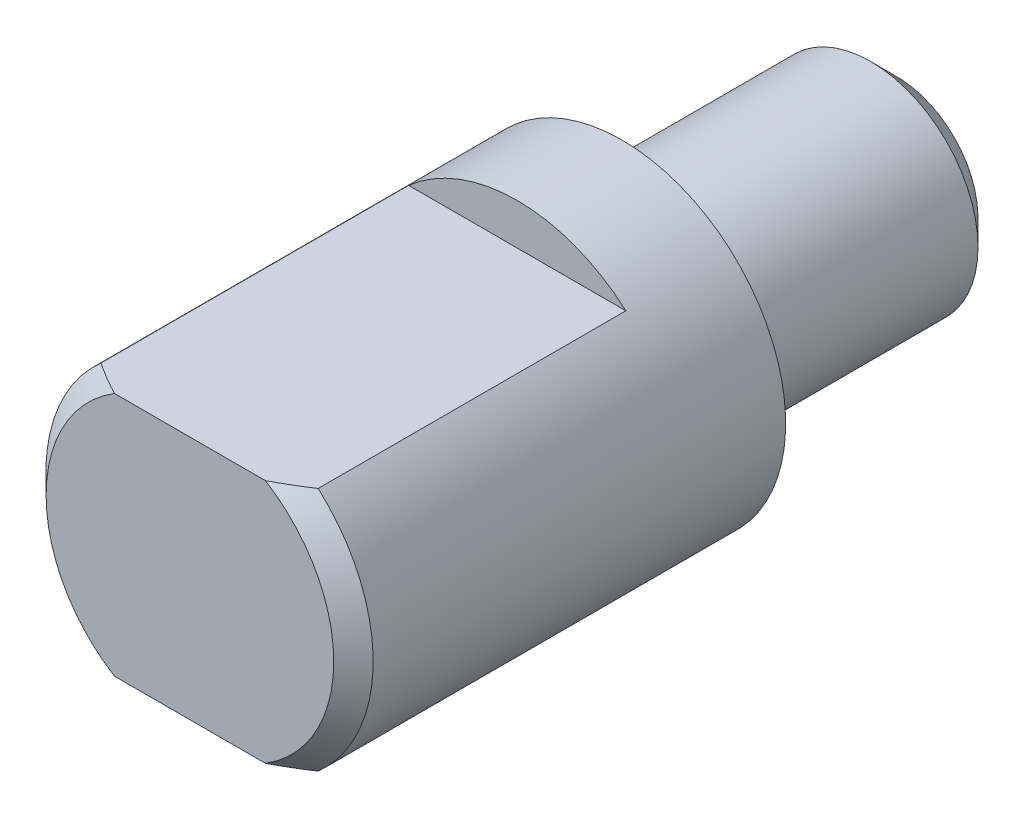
from build123d import *

# Parameters (mm, degrees)
SKETCH2_W          = 6.35
SKETCH2_H          = 0.8
CUT_EXTRUDE1_DEPTH = 5


with BuildPart() as part:
    # Sketch1 → Revolve1 (revolve)
    with BuildSketch(Plane(origin=(0, 0, 0), x_dir=(0, 0, -1), z_dir=(1, 0, 0)), mode=Mode.PRIVATE) as revolve1_sk:
        Polygon((9.652, 1.57), (9.142, 2.0828), (4.318, 2.0828), (4.318, 3.175), (-3.684, 3.175), (-4.064, 2.79), (-4.064, 0), (9.652, 0), align=None)
    revolve(revolve1_sk.sketch.rotate(Axis((0, 0, 4.064), (0, 0, -1)), 180), axis=Axis((0, 0, 4.064), (0, 0, -1)))

    # Sketch2 → Cut-Extrude1 (cut, symmetric)
    with BuildSketch(Plane(origin=(0, 0, 0), x_dir=(0, 0, -1), z_dir=(1, 0, 0))):
        with Locations((-0.889, 2.775)):
            Rectangle(SKETCH2_W, SKETCH2_H)
        with Locations((-0.889, -2.775)):
            Rectangle(SKETCH2_W, SKETCH2_H)
    extrude(amount=CUT_EXTRUDE1_DEPTH, both=True, mode=Mode.SUBTRACT)


solid = part.part
